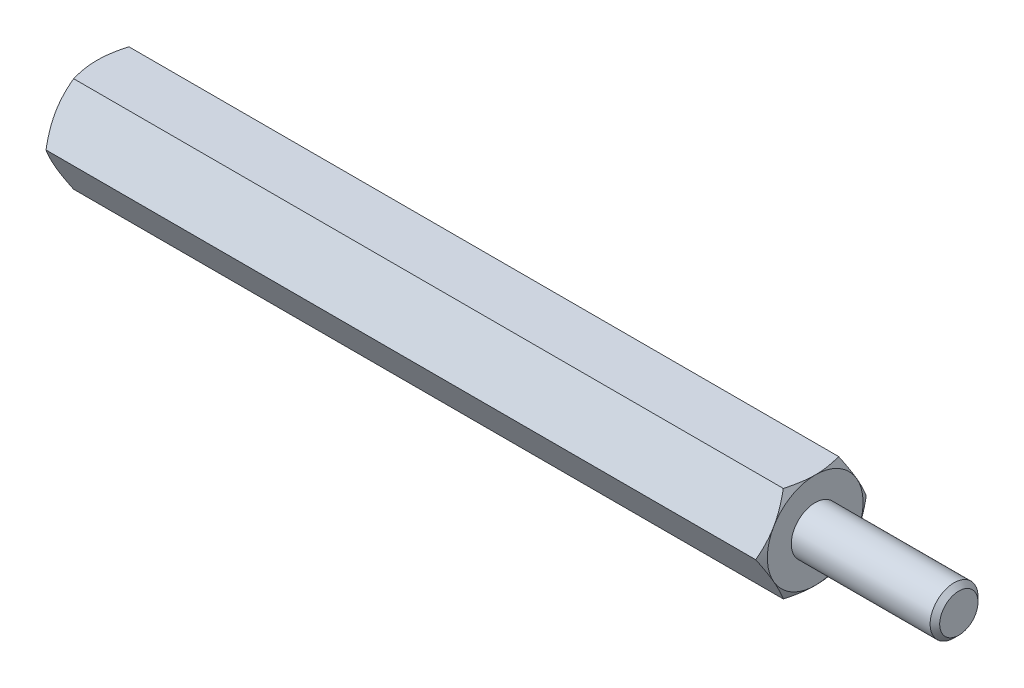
ISO-10303-21;
HEADER;
FILE_DESCRIPTION(('STEP AP214'),'2;1');
FILE_NAME('part.step','',(''),(''),'','','');
FILE_SCHEMA(('AUTOMOTIVE_DESIGN { 1 0 10303 214 1 1 1 1 }'));
ENDSEC;
DATA;
#1=APPLICATION_CONTEXT('core data for automotive mechanical design processes');
#2=APPLICATION_PROTOCOL_DEFINITION('international standard','automotive_design',2000,#1);
#3=PRODUCT_CONTEXT('',#1,'mechanical');
#4=PRODUCT('Part','Part','',(#3));
#5=PRODUCT_RELATED_PRODUCT_CATEGORY('part','',(#4));
#6=PRODUCT_DEFINITION_FORMATION('','',#4);
#7=PRODUCT_DEFINITION_CONTEXT('part definition',#1,'design');
#8=PRODUCT_DEFINITION('design','',#6,#7);
#9=PRODUCT_DEFINITION_SHAPE('','',#8);
#10=(LENGTH_UNIT() NAMED_UNIT(*) SI_UNIT(.MILLI.,.METRE.));
#11=(NAMED_UNIT(*) PLANE_ANGLE_UNIT() SI_UNIT($,.RADIAN.));
#12=(NAMED_UNIT(*) SI_UNIT($,.STERADIAN.) SOLID_ANGLE_UNIT());
#13=UNCERTAINTY_MEASURE_WITH_UNIT(LENGTH_MEASURE(1.E-05),#10,'distance_accuracy_value','');
#14=(GEOMETRIC_REPRESENTATION_CONTEXT(3) GLOBAL_UNCERTAINTY_ASSIGNED_CONTEXT((#13)) GLOBAL_UNIT_ASSIGNED_CONTEXT((#10,
#11,#12)) REPRESENTATION_CONTEXT('',''));
#15=CARTESIAN_POINT('',(0.,0.,0.));
#16=DIRECTION('',(0.,0.,1.));
#17=DIRECTION('',(1.,0.,0.));
#18=AXIS2_PLACEMENT_3D('',#15,#16,#17);
#19=CARTESIAN_POINT('',(15.,2.,-1.15470053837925));
#20=DIRECTION('',(1.,0.,0.));
#21=DIRECTION('',(0.,0.,-1.));
#22=AXIS2_PLACEMENT_3D('',#19,#20,#21);
#23=PLANE('',#22);
#24=CARTESIAN_POINT('',(15.,0.,0.));
#25=DIRECTION('',(1.,0.,0.));
#26=DIRECTION('',(0.,0.,-1.));
#27=AXIS2_PLACEMENT_3D('',#24,#25,#26);
#28=CIRCLE('',#27,2.);
#29=CARTESIAN_POINT('',(15.,-1.,-1.73205080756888));
#30=VERTEX_POINT('',#29);
#31=CARTESIAN_POINT('',(15.,0.999999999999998,-1.73205080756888));
#32=VERTEX_POINT('',#31);
#33=EDGE_CURVE('E288',#30,#32,#28,.T.);
#34=ORIENTED_EDGE('',*,*,#33,.T.);
#35=CARTESIAN_POINT('',(15.,2.,0.));
#36=VERTEX_POINT('',#35);
#37=EDGE_CURVE('E53',#32,#36,#28,.T.);
#38=ORIENTED_EDGE('',*,*,#37,.T.);
#39=CARTESIAN_POINT('',(15.,0.999999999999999,1.73205080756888));
#40=VERTEX_POINT('',#39);
#41=EDGE_CURVE('E297',#36,#40,#28,.T.);
#42=ORIENTED_EDGE('',*,*,#41,.T.);
#43=CARTESIAN_POINT('',(15.,-1.,1.73205080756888));
#44=VERTEX_POINT('',#43);
#45=EDGE_CURVE('E302',#40,#44,#28,.T.);
#46=ORIENTED_EDGE('',*,*,#45,.T.);
#47=CARTESIAN_POINT('',(15.,0.,0.));
#48=DIRECTION('',(-1.,0.,0.));
#49=DIRECTION('',(0.,-1.,0.));
#50=AXIS2_PLACEMENT_3D('',#47,#48,#49);
#51=CIRCLE('',#50,2.);
#52=CARTESIAN_POINT('',(15.,-2.00000000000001,0.));
#53=VERTEX_POINT('',#52);
#54=EDGE_CURVE('E193',#53,#44,#51,.T.);
#55=ORIENTED_EDGE('',*,*,#54,.F.);
#56=EDGE_CURVE('E61',#53,#30,#28,.T.);
#57=ORIENTED_EDGE('',*,*,#56,.T.);
#58=EDGE_LOOP('',(#34,#38,#42,#46,#55,#57));
#59=FACE_BOUND('',#58,.T.);
#60=CARTESIAN_POINT('',(15.,0.,0.));
#61=DIRECTION('',(1.,0.,0.));
#62=DIRECTION('',(0.,0.,-1.));
#63=AXIS2_PLACEMENT_3D('',#60,#61,#62);
#64=CIRCLE('',#63,1.);
#65=CARTESIAN_POINT('',(15.,0.,-1.));
#66=VERTEX_POINT('',#65);
#67=EDGE_CURVE('E320',#66,#66,#64,.T.);
#68=ORIENTED_EDGE('',*,*,#67,.F.);
#69=EDGE_LOOP('',(#68));
#70=FACE_BOUND('',#69,.T.);
#71=ADVANCED_FACE('F37',(#59,#70),#23,.T.);
#72=CARTESIAN_POINT('',(15.,0.,-2.3094010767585));
#73=DIRECTION('',(0.,-0.5,0.866025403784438));
#74=DIRECTION('',(0.,-0.866025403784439,-0.5));
#75=AXIS2_PLACEMENT_3D('',#72,#73,#74);
#76=PLANE('',#75);
#77=CARTESIAN_POINT('',(14.8213005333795,-0.000200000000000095,-2.30951654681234));
#78=CARTESIAN_POINT('',(14.8506104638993,0.0876912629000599,-2.25877250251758));
#79=CARTESIAN_POINT('',(14.8772671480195,0.176341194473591,-2.20759044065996));
#80=CARTESIAN_POINT('',(14.9237975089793,0.355176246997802,-2.10433997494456));
#81=CARTESIAN_POINT('',(14.9436547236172,0.445364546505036,-2.05226973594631));
#82=CARTESIAN_POINT('',(14.9745665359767,0.624623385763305,-1.94877459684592));
#83=CARTESIAN_POINT('',(14.9858268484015,0.713666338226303,-1.89736562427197));
#84=CARTESIAN_POINT('',(14.9992713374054,0.892171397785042,-1.79430568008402));
#85=CARTESIAN_POINT('',(15.0014666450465,0.981632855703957,-1.74265508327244));
#86=CARTESIAN_POINT('',(14.9969090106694,1.1488083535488,-1.64613626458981));
#87=CARTESIAN_POINT('',(14.991275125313,1.22654737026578,-1.60125362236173));
#88=CARTESIAN_POINT('',(14.9734161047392,1.38151891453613,-1.51178075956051));
#89=CARTESIAN_POINT('',(14.9611848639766,1.4587509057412,-1.46719084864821));
#90=CARTESIAN_POINT('',(14.9306065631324,1.6140421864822,-1.37753338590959));
#91=CARTESIAN_POINT('',(14.9121298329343,1.69208181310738,-1.33247718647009));
#92=CARTESIAN_POINT('',(14.8701944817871,1.84699686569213,-1.24303693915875));
#93=CARTESIAN_POINT('',(14.8467457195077,1.92387427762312,-1.1986517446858));
#94=CARTESIAN_POINT('',(14.8213005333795,2.0002,-1.15458506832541));
#95=B_SPLINE_CURVE_WITH_KNOTS('',3,(#77,#78,#79,#80,#81,#82,#83,#84,#85,#86,#87,#88,#89,#90,#91,
#92,#93,#94),.UNSPECIFIED.,.F.,.F.,(4,2,2,2,2,2,2,2,4),(0.,0.31703182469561,0.634825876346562,
0.944753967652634,1.25430138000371,1.52387047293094,1.79368946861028,2.06949491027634,
2.34475850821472),.UNSPECIFIED.);
#96=CARTESIAN_POINT('',(14.8213672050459,0.,-2.3094010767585));
#97=VERTEX_POINT('',#96);
#98=EDGE_CURVE('E318',#97,#32,#95,.T.);
#99=ORIENTED_EDGE('',*,*,#98,.F.);
#100=DIRECTION('',(-1.,0.,0.));
#101=VECTOR('',#100,1.);
#102=CARTESIAN_POINT('',(15.,0.,-2.3094010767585));
#103=LINE('',#102,#101);
#104=CARTESIAN_POINT('',(-14.8213672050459,0.,-2.3094010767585));
#105=VERTEX_POINT('',#104);
#106=EDGE_CURVE('E264',#97,#105,#103,.T.);
#107=ORIENTED_EDGE('',*,*,#106,.T.);
#108=CARTESIAN_POINT('',(-14.8213005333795,2.0002,-1.15458506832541));
#109=CARTESIAN_POINT('',(-14.8506104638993,1.91230873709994,-1.20532911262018));
#110=CARTESIAN_POINT('',(-14.8772671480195,1.82365880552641,-1.2565111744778));
#111=CARTESIAN_POINT('',(-14.9237975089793,1.6448237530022,-1.35976164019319));
#112=CARTESIAN_POINT('',(-14.9436547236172,1.55463545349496,-1.41183187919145));
#113=CARTESIAN_POINT('',(-14.9745665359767,1.37537661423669,-1.51532701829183));
#114=CARTESIAN_POINT('',(-14.9858268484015,1.2863336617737,-1.56673599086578));
#115=CARTESIAN_POINT('',(-14.9992713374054,1.10782860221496,-1.66979593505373));
#116=CARTESIAN_POINT('',(-15.0014666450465,1.01836714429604,-1.72144653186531));
#117=CARTESIAN_POINT('',(-14.9969090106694,0.851191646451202,-1.81796535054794));
#118=CARTESIAN_POINT('',(-14.991275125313,0.773452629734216,-1.86284799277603));
#119=CARTESIAN_POINT('',(-14.9734161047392,0.618481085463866,-1.95232085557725));
#120=CARTESIAN_POINT('',(-14.9611848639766,0.541249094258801,-1.99691076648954));
#121=CARTESIAN_POINT('',(-14.9306065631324,0.385957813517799,-2.08656822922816));
#122=CARTESIAN_POINT('',(-14.9121298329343,0.30791818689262,-2.13162442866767));
#123=CARTESIAN_POINT('',(-14.8701944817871,0.153003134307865,-2.221064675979));
#124=CARTESIAN_POINT('',(-14.8467457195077,0.0761257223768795,-2.26544987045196));
#125=CARTESIAN_POINT('',(-14.8213005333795,-0.000200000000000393,-2.30951654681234));
#126=B_SPLINE_CURVE_WITH_KNOTS('',3,(#108,#109,#110,#111,#112,#113,#114,#115,#116,#117,#118,
#119,#120,#121,#122,#123,#124,#125),.UNSPECIFIED.,.F.,.F.,(4,2,2,2,2,2,2,2,4),(0.,
0.31703182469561,0.634825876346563,0.944753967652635,1.25430138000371,1.52387047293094,
1.79368946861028,2.06949491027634,2.34475850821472),.UNSPECIFIED.);
#127=CARTESIAN_POINT('',(-15.,0.999999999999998,-1.73205080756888));
#128=VERTEX_POINT('',#127);
#129=EDGE_CURVE('E404',#128,#105,#126,.T.);
#130=ORIENTED_EDGE('',*,*,#129,.F.);
#131=CARTESIAN_POINT('',(-14.8213672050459,2.,-1.15470053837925));
#132=VERTEX_POINT('',#131);
#133=EDGE_CURVE('E400',#132,#128,#126,.T.);
#134=ORIENTED_EDGE('',*,*,#133,.F.);
#135=DIRECTION('',(-1.,0.,0.));
#136=VECTOR('',#135,1.);
#137=CARTESIAN_POINT('',(15.,2.,-1.15470053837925));
#138=LINE('',#137,#136);
#139=CARTESIAN_POINT('',(14.821367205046,2.,-1.15470053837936));
#140=VERTEX_POINT('',#139);
#141=EDGE_CURVE('E279',#140,#132,#138,.T.);
#142=ORIENTED_EDGE('',*,*,#141,.F.);
#143=EDGE_CURVE('E229',#32,#140,#95,.T.);
#144=ORIENTED_EDGE('',*,*,#143,.F.);
#145=EDGE_LOOP('',(#99,#107,#130,#134,#142,#144));
#146=FACE_BOUND('',#145,.T.);
#147=ADVANCED_FACE('F148',(#146),#76,.F.);
#148=CARTESIAN_POINT('',(15.,2.,-1.15470053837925));
#149=DIRECTION('',(0.,-1.,0.));
#150=DIRECTION('',(0.,0.,-1.));
#151=AXIS2_PLACEMENT_3D('',#148,#149,#150);
#152=PLANE('',#151);
#153=CARTESIAN_POINT('',(14.0041453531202,2.,-3.14239762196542));
#154=CARTESIAN_POINT('',(14.0468568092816,2.,-3.05468337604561));
#155=CARTESIAN_POINT('',(14.0891703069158,2.,-2.96677207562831));
#156=CARTESIAN_POINT('',(14.1727783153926,2.,-2.79045070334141));
#157=CARTESIAN_POINT('',(14.2140726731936,2.,-2.70204055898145));
#158=CARTESIAN_POINT('',(14.2956183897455,2.,-2.52418069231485));
#159=CARTESIAN_POINT('',(14.3358631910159,2.,-2.43472795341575));
#160=CARTESIAN_POINT('',(14.4147590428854,2.,-2.25512498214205));
#161=CARTESIAN_POINT('',(14.4534101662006,2.,-2.16497478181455));
#162=CARTESIAN_POINT('',(14.5299661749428,2.,-1.98078525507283));
#163=CARTESIAN_POINT('',(14.5678021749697,2.,-1.88671714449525));
#164=CARTESIAN_POINT('',(14.6407004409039,2.,-1.69751412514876));
#165=CARTESIAN_POINT('',(14.6757629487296,2.,-1.60237931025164));
#166=CARTESIAN_POINT('',(14.7422353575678,2.,-1.41102905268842));
#167=CARTESIAN_POINT('',(14.7736519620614,2.,-1.31481596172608));
#168=CARTESIAN_POINT('',(14.8318476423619,2.,-1.12101028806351));
#169=CARTESIAN_POINT('',(14.8586281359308,2.,-1.02341813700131));
#170=CARTESIAN_POINT('',(14.9061516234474,2.,-0.827336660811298));
#171=CARTESIAN_POINT('',(14.9269281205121,2.,-0.728855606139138));
#172=CARTESIAN_POINT('',(14.9612955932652,2.,-0.530628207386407));
#173=CARTESIAN_POINT('',(14.9748873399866,2.,-0.430882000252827));
#174=CARTESIAN_POINT('',(14.9936215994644,2.,-0.231937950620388));
#175=CARTESIAN_POINT('',(14.998875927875,2.,-0.132750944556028));
#176=CARTESIAN_POINT('',(15.0007996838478,2.,0.0657049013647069));
#177=CARTESIAN_POINT('',(14.9974689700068,2.,0.164973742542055));
#178=CARTESIAN_POINT('',(14.9796512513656,2.,0.400692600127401));
#179=CARTESIAN_POINT('',(14.9613884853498,2.,0.53685971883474));
#180=CARTESIAN_POINT('',(14.9117995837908,2.,0.80679264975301));
#181=CARTESIAN_POINT('',(14.8804615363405,2.,0.940556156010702));
#182=CARTESIAN_POINT('',(14.8073369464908,2.,1.20849227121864));
#183=CARTESIAN_POINT('',(14.7653231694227,2.,1.34260127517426));
#184=CARTESIAN_POINT('',(14.6970115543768,2.,1.54188460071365));
#185=CARTESIAN_POINT('',(14.6733612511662,2.,1.6079939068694));
#186=CARTESIAN_POINT('',(14.6245731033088,2.,1.73966131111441));
#187=CARTESIAN_POINT('',(14.5994352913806,2.,1.80521942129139));
#188=CARTESIAN_POINT('',(14.5304524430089,2.,1.98014362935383));
#189=CARTESIAN_POINT('',(14.4854828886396,2.,2.08906517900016));
#190=CARTESIAN_POINT('',(14.3929395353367,2.,2.3058004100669));
#191=CARTESIAN_POINT('',(14.345365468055,2.,2.41361397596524));
#192=CARTESIAN_POINT('',(14.2482262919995,2.,2.62838132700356));
#193=CARTESIAN_POINT('',(14.1986605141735,2.,2.7353348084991));
#194=CARTESIAN_POINT('',(14.0980014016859,2.,2.94852186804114));
#195=CARTESIAN_POINT('',(14.046908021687,2.,3.05475542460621));
#196=CARTESIAN_POINT('',(13.8916961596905,2.,3.37291303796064));
#197=CARTESIAN_POINT('',(13.7857965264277,2.,3.58396705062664));
#198=CARTESIAN_POINT('',(13.5710098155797,2.,4.00448363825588));
#199=CARTESIAN_POINT('',(13.4621233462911,2.,4.21394652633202));
#200=CARTESIAN_POINT('',(13.2537677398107,2.,4.61000648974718));
#201=CARTESIAN_POINT('',(13.1545007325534,2.,4.79671008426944));
#202=CARTESIAN_POINT('',(12.9547641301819,2.,5.16948614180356));
#203=CARTESIAN_POINT('',(12.8542944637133,2.,5.35555856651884));
#204=CARTESIAN_POINT('',(12.6527937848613,2.,5.72660635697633));
#205=CARTESIAN_POINT('',(12.5517657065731,2.,5.91158331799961));
#206=CARTESIAN_POINT('',(12.3490239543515,2.,6.28114276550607));
#207=CARTESIAN_POINT('',(12.2473103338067,2.,6.46572528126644));
#208=CARTESIAN_POINT('',(12.1453470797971,2.,6.65016883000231));
#209=B_SPLINE_CURVE_WITH_KNOTS('',3,(#153,#154,#155,#156,#157,#158,#159,#160,#161,#162,#163,
#164,#165,#166,#167,#168,#169,#170,#171,#172,#173,#174,#175,#176,#177,#178,#179,#180,#181,#182,
#183,#184,#185,#186,#187,#188,#189,#190,#191,#192,#193,#194,#195,#196,#197,#198,#199,#200,#201,
#202,#203,#204,#205,#206,#207,#208),.UNSPECIFIED.,.F.,.F.,(4,2,2,2,2,2,2,2,2,2,2,2,2,2,2,2,2,2,
2,2,2,2,2,2,2,2,2,4),(0.,0.292684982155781,0.585413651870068,0.879667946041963,1.17390879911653,
1.47805164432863,1.78216793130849,2.08571589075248,2.38917085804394,2.690898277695,
2.99259331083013,3.29020694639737,3.58782548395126,3.99913738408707,4.41082482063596,
4.8321411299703,5.0427662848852,5.25338680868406,5.60685637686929,5.96036243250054,
6.31398824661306,6.66762456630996,7.37597688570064,8.08418599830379,8.71853756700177,
9.3529269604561,9.98522933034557,10.6174830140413),.UNSPECIFIED.);
#210=EDGE_CURVE('E227',#140,#36,#209,.T.);
#211=ORIENTED_EDGE('',*,*,#210,.F.);
#212=ORIENTED_EDGE('',*,*,#141,.T.);
#213=CARTESIAN_POINT('',(-14.0041453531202,2.,-3.14239762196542));
#214=CARTESIAN_POINT('',(-14.0468568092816,2.,-3.05468337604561));
#215=CARTESIAN_POINT('',(-14.0891703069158,2.,-2.96677207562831));
#216=CARTESIAN_POINT('',(-14.1727783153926,2.,-2.79045070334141));
#217=CARTESIAN_POINT('',(-14.2140726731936,2.,-2.70204055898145));
#218=CARTESIAN_POINT('',(-14.2956183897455,2.,-2.52418069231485));
#219=CARTESIAN_POINT('',(-14.3358631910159,2.,-2.43472795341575));
#220=CARTESIAN_POINT('',(-14.4147590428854,2.,-2.25512498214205));
#221=CARTESIAN_POINT('',(-14.4534101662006,2.,-2.16497478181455));
#222=CARTESIAN_POINT('',(-14.5299661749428,2.,-1.98078525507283));
#223=CARTESIAN_POINT('',(-14.5678021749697,2.,-1.88671714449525));
#224=CARTESIAN_POINT('',(-14.6407004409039,2.,-1.69751412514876));
#225=CARTESIAN_POINT('',(-14.6757629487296,2.,-1.60237931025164));
#226=CARTESIAN_POINT('',(-14.7422353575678,2.,-1.41102905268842));
#227=CARTESIAN_POINT('',(-14.7736519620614,2.,-1.31481596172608));
#228=CARTESIAN_POINT('',(-14.8318476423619,2.,-1.12101028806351));
#229=CARTESIAN_POINT('',(-14.8586281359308,2.,-1.02341813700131));
#230=CARTESIAN_POINT('',(-14.9061516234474,2.,-0.827336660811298));
#231=CARTESIAN_POINT('',(-14.9269281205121,2.,-0.728855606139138));
#232=CARTESIAN_POINT('',(-14.9612955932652,2.,-0.530628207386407));
#233=CARTESIAN_POINT('',(-14.9748873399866,2.,-0.430882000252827));
#234=CARTESIAN_POINT('',(-14.9936215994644,2.,-0.231937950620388));
#235=CARTESIAN_POINT('',(-14.998875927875,2.,-0.132750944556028));
#236=CARTESIAN_POINT('',(-15.0007996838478,2.,0.0657049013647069));
#237=CARTESIAN_POINT('',(-14.9974689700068,2.,0.164973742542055));
#238=CARTESIAN_POINT('',(-14.9796512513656,2.,0.400692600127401));
#239=CARTESIAN_POINT('',(-14.9613884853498,2.,0.53685971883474));
#240=CARTESIAN_POINT('',(-14.9117995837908,2.,0.806792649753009));
#241=CARTESIAN_POINT('',(-14.8804615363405,2.,0.940556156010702));
#242=CARTESIAN_POINT('',(-14.8073369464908,2.,1.20849227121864));
#243=CARTESIAN_POINT('',(-14.7653231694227,2.,1.34260127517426));
#244=CARTESIAN_POINT('',(-14.6970115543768,2.,1.54188460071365));
#245=CARTESIAN_POINT('',(-14.6733612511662,2.,1.6079939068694));
#246=CARTESIAN_POINT('',(-14.6245731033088,2.,1.73966131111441));
#247=CARTESIAN_POINT('',(-14.5994352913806,2.,1.80521942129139));
#248=CARTESIAN_POINT('',(-14.530452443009,2.,1.98014362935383));
#249=CARTESIAN_POINT('',(-14.4854828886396,2.,2.08906517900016));
#250=CARTESIAN_POINT('',(-14.3929395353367,2.,2.3058004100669));
#251=CARTESIAN_POINT('',(-14.345365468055,2.,2.41361397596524));
#252=CARTESIAN_POINT('',(-14.2482262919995,2.,2.62838132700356));
#253=CARTESIAN_POINT('',(-14.1986605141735,2.,2.7353348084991));
#254=CARTESIAN_POINT('',(-14.0980014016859,2.,2.94852186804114));
#255=CARTESIAN_POINT('',(-14.046908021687,2.,3.05475542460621));
#256=CARTESIAN_POINT('',(-13.8916961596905,2.,3.37291303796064));
#257=CARTESIAN_POINT('',(-13.7857965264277,2.,3.58396705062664));
#258=CARTESIAN_POINT('',(-13.5710098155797,2.,4.00448363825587));
#259=CARTESIAN_POINT('',(-13.4621233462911,2.,4.21394652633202));
#260=CARTESIAN_POINT('',(-13.2537677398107,2.,4.61000648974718));
#261=CARTESIAN_POINT('',(-13.1545007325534,2.,4.79671008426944));
#262=CARTESIAN_POINT('',(-12.9547641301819,2.,5.16948614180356));
#263=CARTESIAN_POINT('',(-12.8542944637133,2.,5.35555856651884));
#264=CARTESIAN_POINT('',(-12.6527937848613,2.,5.72660635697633));
#265=CARTESIAN_POINT('',(-12.5517657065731,2.,5.9115833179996));
#266=CARTESIAN_POINT('',(-12.3490239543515,2.,6.28114276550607));
#267=CARTESIAN_POINT('',(-12.2473103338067,2.,6.46572528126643));
#268=CARTESIAN_POINT('',(-12.1453470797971,2.,6.65016883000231));
#269=B_SPLINE_CURVE_WITH_KNOTS('',3,(#213,#214,#215,#216,#217,#218,#219,#220,#221,#222,#223,
#224,#225,#226,#227,#228,#229,#230,#231,#232,#233,#234,#235,#236,#237,#238,#239,#240,#241,#242,
#243,#244,#245,#246,#247,#248,#249,#250,#251,#252,#253,#254,#255,#256,#257,#258,#259,#260,#261,
#262,#263,#264,#265,#266,#267,#268),.UNSPECIFIED.,.F.,.F.,(4,2,2,2,2,2,2,2,2,2,2,2,2,2,2,2,2,2,
2,2,2,2,2,2,2,2,2,4),(0.,0.292684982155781,0.585413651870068,0.879667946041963,1.17390879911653,
1.47805164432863,1.78216793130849,2.08571589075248,2.38917085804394,2.690898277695,
2.99259331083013,3.29020694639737,3.58782548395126,3.99913738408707,4.41082482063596,
4.8321411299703,5.0427662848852,5.25338680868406,5.60685637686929,5.96036243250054,
6.31398824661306,6.66762456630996,7.37597688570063,8.08418599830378,8.71853756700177,
9.3529269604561,9.98522933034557,10.6174830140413),.UNSPECIFIED.);
#270=CARTESIAN_POINT('',(-15.,2.,0.));
#271=VERTEX_POINT('',#270);
#272=EDGE_CURVE('E241',#271,#132,#269,.F.);
#273=ORIENTED_EDGE('',*,*,#272,.F.);
#274=CARTESIAN_POINT('',(-14.8213672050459,2.,1.15470053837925));
#275=VERTEX_POINT('',#274);
#276=EDGE_CURVE('E249',#275,#271,#269,.F.);
#277=ORIENTED_EDGE('',*,*,#276,.F.);
#278=DIRECTION('',(-1.,0.,0.));
#279=VECTOR('',#278,1.);
#280=CARTESIAN_POINT('',(15.,2.,1.15470053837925));
#281=LINE('',#280,#279);
#282=CARTESIAN_POINT('',(14.8213672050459,2.,1.15470053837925));
#283=VERTEX_POINT('',#282);
#284=EDGE_CURVE('E276',#283,#275,#281,.T.);
#285=ORIENTED_EDGE('',*,*,#284,.F.);
#286=EDGE_CURVE('E221',#36,#283,#209,.T.);
#287=ORIENTED_EDGE('',*,*,#286,.F.);
#288=EDGE_LOOP('',(#211,#212,#273,#277,#285,#287));
#289=FACE_BOUND('',#288,.T.);
#290=ADVANCED_FACE('F153',(#289),#152,.F.);
#291=CARTESIAN_POINT('',(15.,2.,1.15470053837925));
#292=DIRECTION('',(0.,-0.5,-0.866025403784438));
#293=DIRECTION('',(0.,0.866025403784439,-0.5));
#294=AXIS2_PLACEMENT_3D('',#291,#292,#293);
#295=PLANE('',#294);
#296=CARTESIAN_POINT('',(14.8213005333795,2.0002,1.15458506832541));
#297=CARTESIAN_POINT('',(14.8506104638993,1.91230873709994,1.20532911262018));
#298=CARTESIAN_POINT('',(14.8772671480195,1.82365880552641,1.2565111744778));
#299=CARTESIAN_POINT('',(14.9237975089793,1.6448237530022,1.35976164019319));
#300=CARTESIAN_POINT('',(14.9436547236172,1.55463545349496,1.41183187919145));
#301=CARTESIAN_POINT('',(14.9745665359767,1.37537661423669,1.51532701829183));
#302=CARTESIAN_POINT('',(14.9858268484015,1.2863336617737,1.56673599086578));
#303=CARTESIAN_POINT('',(14.9992713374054,1.10782860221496,1.66979593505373));
#304=CARTESIAN_POINT('',(15.0014666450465,1.01836714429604,1.72144653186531));
#305=CARTESIAN_POINT('',(14.9969090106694,0.851191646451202,1.81796535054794));
#306=CARTESIAN_POINT('',(14.991275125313,0.773452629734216,1.86284799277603));
#307=CARTESIAN_POINT('',(14.9734161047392,0.618481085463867,1.95232085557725));
#308=CARTESIAN_POINT('',(14.9611848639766,0.541249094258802,1.99691076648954));
#309=CARTESIAN_POINT('',(14.9306065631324,0.3859578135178,2.08656822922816));
#310=CARTESIAN_POINT('',(14.9121298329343,0.307918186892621,2.13162442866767));
#311=CARTESIAN_POINT('',(14.8701944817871,0.153003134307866,2.221064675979));
#312=CARTESIAN_POINT('',(14.8467457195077,0.0761257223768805,2.26544987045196));
#313=CARTESIAN_POINT('',(14.8213005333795,-0.000199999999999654,2.30951654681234));
#314=B_SPLINE_CURVE_WITH_KNOTS('',3,(#296,#297,#298,#299,#300,#301,#302,#303,#304,#305,#306,
#307,#308,#309,#310,#311,#312,#313),.UNSPECIFIED.,.F.,.F.,(4,2,2,2,2,2,2,2,4),(0.,
0.31703182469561,0.634825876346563,0.944753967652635,1.25430138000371,1.52387047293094,
1.79368946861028,2.06949491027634,2.34475850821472),.UNSPECIFIED.);
#315=EDGE_CURVE('E228',#283,#40,#314,.T.);
#316=ORIENTED_EDGE('',*,*,#315,.F.);
#317=ORIENTED_EDGE('',*,*,#284,.T.);
#318=CARTESIAN_POINT('',(-14.8213005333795,-0.000199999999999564,2.30951654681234));
#319=CARTESIAN_POINT('',(-14.8506104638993,0.0876912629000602,2.25877250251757));
#320=CARTESIAN_POINT('',(-14.8772671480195,0.176341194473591,2.20759044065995));
#321=CARTESIAN_POINT('',(-14.9237975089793,0.355176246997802,2.10433997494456));
#322=CARTESIAN_POINT('',(-14.9436547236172,0.445364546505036,2.0522697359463));
#323=CARTESIAN_POINT('',(-14.9745665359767,0.624623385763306,1.94877459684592));
#324=CARTESIAN_POINT('',(-14.9858268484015,0.713666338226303,1.89736562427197));
#325=CARTESIAN_POINT('',(-14.9992713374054,0.892171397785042,1.79430568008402));
#326=CARTESIAN_POINT('',(-15.0014666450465,0.981632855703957,1.74265508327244));
#327=CARTESIAN_POINT('',(-14.9969090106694,1.1488083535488,1.64613626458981));
#328=CARTESIAN_POINT('',(-14.991275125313,1.22654737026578,1.60125362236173));
#329=CARTESIAN_POINT('',(-14.9734161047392,1.38151891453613,1.51178075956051));
#330=CARTESIAN_POINT('',(-14.9611848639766,1.4587509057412,1.46719084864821));
#331=CARTESIAN_POINT('',(-14.9306065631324,1.6140421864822,1.37753338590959));
#332=CARTESIAN_POINT('',(-14.9121298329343,1.69208181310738,1.33247718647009));
#333=CARTESIAN_POINT('',(-14.8701944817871,1.84699686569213,1.24303693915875));
#334=CARTESIAN_POINT('',(-14.8467457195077,1.92387427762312,1.1986517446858));
#335=CARTESIAN_POINT('',(-14.8213005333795,2.0002,1.15458506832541));
#336=B_SPLINE_CURVE_WITH_KNOTS('',3,(#318,#319,#320,#321,#322,#323,#324,#325,#326,#327,#328,
#329,#330,#331,#332,#333,#334,#335),.UNSPECIFIED.,.F.,.F.,(4,2,2,2,2,2,2,2,4),(0.,
0.317031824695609,0.634825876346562,0.944753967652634,1.25430138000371,1.52387047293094,
1.79368946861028,2.06949491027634,2.34475850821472),.UNSPECIFIED.);
#337=CARTESIAN_POINT('',(-15.,0.999999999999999,1.73205080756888));
#338=VERTEX_POINT('',#337);
#339=EDGE_CURVE('E255',#338,#275,#336,.T.);
#340=ORIENTED_EDGE('',*,*,#339,.F.);
#341=CARTESIAN_POINT('',(-14.8213672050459,0.,2.3094010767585));
#342=VERTEX_POINT('',#341);
#343=EDGE_CURVE('E262',#342,#338,#336,.T.);
#344=ORIENTED_EDGE('',*,*,#343,.F.);
#345=DIRECTION('',(-1.,0.,0.));
#346=VECTOR('',#345,1.);
#347=CARTESIAN_POINT('',(15.,0.,2.3094010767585));
#348=LINE('',#347,#346);
#349=CARTESIAN_POINT('',(14.8213672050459,0.,2.3094010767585));
#350=VERTEX_POINT('',#349);
#351=EDGE_CURVE('E273',#350,#342,#348,.T.);
#352=ORIENTED_EDGE('',*,*,#351,.F.);
#353=EDGE_CURVE('E215',#40,#350,#314,.T.);
#354=ORIENTED_EDGE('',*,*,#353,.F.);
#355=EDGE_LOOP('',(#316,#317,#340,#344,#352,#354));
#356=FACE_BOUND('',#355,.T.);
#357=ADVANCED_FACE('F235',(#356),#295,.F.);
#358=CARTESIAN_POINT('',(15.,0.,2.3094010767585));
#359=DIRECTION('',(0.,0.5,-0.866025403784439));
#360=DIRECTION('',(0.,0.866025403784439,0.5));
#361=AXIS2_PLACEMENT_3D('',#358,#359,#360);
#362=PLANE('',#361);
#363=CARTESIAN_POINT('',(14.8213005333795,0.00020000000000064,2.30951654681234));
#364=CARTESIAN_POINT('',(14.8506104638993,-0.0876912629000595,2.25877250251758));
#365=CARTESIAN_POINT('',(14.8772671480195,-0.17634119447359,2.20759044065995));
#366=CARTESIAN_POINT('',(14.9237975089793,-0.355176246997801,2.10433997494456));
#367=CARTESIAN_POINT('',(14.9436547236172,-0.445364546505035,2.0522697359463));
#368=CARTESIAN_POINT('',(14.9745665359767,-0.624623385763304,1.94877459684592));
#369=CARTESIAN_POINT('',(14.9858268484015,-0.713666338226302,1.89736562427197));
#370=CARTESIAN_POINT('',(14.9992713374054,-0.892171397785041,1.79430568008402));
#371=CARTESIAN_POINT('',(15.0014666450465,-0.981632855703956,1.74265508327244));
#372=CARTESIAN_POINT('',(14.9969090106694,-1.1488083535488,1.64613626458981));
#373=CARTESIAN_POINT('',(14.991275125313,-1.22654737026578,1.60125362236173));
#374=CARTESIAN_POINT('',(14.9734161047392,-1.38151891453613,1.51178075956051));
#375=CARTESIAN_POINT('',(14.9611848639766,-1.4587509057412,1.46719084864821));
#376=CARTESIAN_POINT('',(14.9306065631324,-1.6140421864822,1.37753338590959));
#377=CARTESIAN_POINT('',(14.9121298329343,-1.69208181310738,1.33247718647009));
#378=CARTESIAN_POINT('',(14.8701944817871,-1.84699686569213,1.24303693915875));
#379=CARTESIAN_POINT('',(14.8467457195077,-1.92387427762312,1.1986517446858));
#380=CARTESIAN_POINT('',(14.8213005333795,-2.0002,1.15458506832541));
#381=B_SPLINE_CURVE_WITH_KNOTS('',3,(#363,#364,#365,#366,#367,#368,#369,#370,#371,#372,#373,
#374,#375,#376,#377,#378,#379,#380),.UNSPECIFIED.,.F.,.F.,(4,2,2,2,2,2,2,2,4),(0.,
0.317031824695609,0.634825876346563,0.944753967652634,1.25430138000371,1.52387047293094,
1.79368946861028,2.06949491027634,2.34475850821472),.UNSPECIFIED.);
#382=EDGE_CURVE('E319',#350,#44,#381,.T.);
#383=ORIENTED_EDGE('',*,*,#382,.F.);
#384=ORIENTED_EDGE('',*,*,#351,.T.);
#385=CARTESIAN_POINT('',(-14.8213005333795,-2.0002,1.15458506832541));
#386=CARTESIAN_POINT('',(-14.8506104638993,-1.91230873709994,1.20532911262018));
#387=CARTESIAN_POINT('',(-14.8772671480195,-1.82365880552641,1.2565111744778));
#388=CARTESIAN_POINT('',(-14.9237975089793,-1.6448237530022,1.35976164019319));
#389=CARTESIAN_POINT('',(-14.9436547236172,-1.55463545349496,1.41183187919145));
#390=CARTESIAN_POINT('',(-14.9745665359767,-1.3753766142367,1.51532701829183));
#391=CARTESIAN_POINT('',(-14.9858268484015,-1.2863336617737,1.56673599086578));
#392=CARTESIAN_POINT('',(-14.9992713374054,-1.10782860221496,1.66979593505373));
#393=CARTESIAN_POINT('',(-15.0014666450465,-1.01836714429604,1.72144653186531));
#394=CARTESIAN_POINT('',(-14.9969090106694,-0.851191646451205,1.81796535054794));
#395=CARTESIAN_POINT('',(-14.991275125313,-0.773452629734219,1.86284799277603));
#396=CARTESIAN_POINT('',(-14.9734161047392,-0.618481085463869,1.95232085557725));
#397=CARTESIAN_POINT('',(-14.9611848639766,-0.541249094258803,1.99691076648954));
#398=CARTESIAN_POINT('',(-14.9306065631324,-0.3859578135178,2.08656822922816));
#399=CARTESIAN_POINT('',(-14.9121298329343,-0.307918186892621,2.13162442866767));
#400=CARTESIAN_POINT('',(-14.8701944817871,-0.153003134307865,2.221064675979));
#401=CARTESIAN_POINT('',(-14.8467457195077,-0.0761257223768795,2.26544987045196));
#402=CARTESIAN_POINT('',(-14.8213005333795,0.000200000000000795,2.30951654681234));
#403=B_SPLINE_CURVE_WITH_KNOTS('',3,(#385,#386,#387,#388,#389,#390,#391,#392,#393,#394,#395,
#396,#397,#398,#399,#400,#401,#402),.UNSPECIFIED.,.F.,.F.,(4,2,2,2,2,2,2,2,4),(0.,
0.317031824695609,0.634825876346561,0.944753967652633,1.25430138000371,1.52387047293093,
1.79368946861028,2.06949491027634,2.34475850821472),.UNSPECIFIED.);
#404=CARTESIAN_POINT('',(-15.,-1.,1.73205080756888));
#405=VERTEX_POINT('',#404);
#406=EDGE_CURVE('E263',#405,#342,#403,.T.);
#407=ORIENTED_EDGE('',*,*,#406,.F.);
#408=CARTESIAN_POINT('',(-14.8213672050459,-2.,1.15470053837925));
#409=VERTEX_POINT('',#408);
#410=EDGE_CURVE('E250',#409,#405,#403,.T.);
#411=ORIENTED_EDGE('',*,*,#410,.F.);
#412=DIRECTION('',(-1.,0.,0.));
#413=VECTOR('',#412,1.);
#414=CARTESIAN_POINT('',(15.,-2.,1.15470053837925));
#415=LINE('',#414,#413);
#416=CARTESIAN_POINT('',(14.8213672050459,-2.,1.15470053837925));
#417=VERTEX_POINT('',#416);
#418=EDGE_CURVE('E270',#417,#409,#415,.T.);
#419=ORIENTED_EDGE('',*,*,#418,.F.);
#420=EDGE_CURVE('E210',#44,#417,#381,.T.);
#421=ORIENTED_EDGE('',*,*,#420,.F.);
#422=EDGE_LOOP('',(#383,#384,#407,#411,#419,#421));
#423=FACE_BOUND('',#422,.T.);
#424=ADVANCED_FACE('F427',(#423),#362,.F.);
#425=CARTESIAN_POINT('',(15.,-2.,1.15470053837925));
#426=DIRECTION('',(0.,1.,0.));
#427=DIRECTION('',(0.,0.,1.));
#428=AXIS2_PLACEMENT_3D('',#425,#426,#427);
#429=PLANE('',#428);
#430=CARTESIAN_POINT('',(14.0041453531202,-2.,-3.14239762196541));
#431=CARTESIAN_POINT('',(14.0468568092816,-2.,-3.05468337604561));
#432=CARTESIAN_POINT('',(14.0891703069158,-2.,-2.96677207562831));
#433=CARTESIAN_POINT('',(14.1727783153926,-2.,-2.79045070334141));
#434=CARTESIAN_POINT('',(14.2140726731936,-2.,-2.70204055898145));
#435=CARTESIAN_POINT('',(14.2956183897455,-2.,-2.52418069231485));
#436=CARTESIAN_POINT('',(14.3358631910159,-2.,-2.43472795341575));
#437=CARTESIAN_POINT('',(14.4147590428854,-2.,-2.25512498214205));
#438=CARTESIAN_POINT('',(14.4534101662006,-2.,-2.16497478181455));
#439=CARTESIAN_POINT('',(14.5299661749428,-2.,-1.98078525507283));
#440=CARTESIAN_POINT('',(14.5678021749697,-2.,-1.88671714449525));
#441=CARTESIAN_POINT('',(14.6407004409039,-2.,-1.69751412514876));
#442=CARTESIAN_POINT('',(14.6757629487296,-2.,-1.60237931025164));
#443=CARTESIAN_POINT('',(14.7422353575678,-2.,-1.41102905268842));
#444=CARTESIAN_POINT('',(14.7736519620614,-2.,-1.31481596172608));
#445=CARTESIAN_POINT('',(14.8318476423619,-2.,-1.12101028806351));
#446=CARTESIAN_POINT('',(14.8586281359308,-2.,-1.02341813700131));
#447=CARTESIAN_POINT('',(14.9061516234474,-2.,-0.827336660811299));
#448=CARTESIAN_POINT('',(14.9269281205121,-2.,-0.72885560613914));
#449=CARTESIAN_POINT('',(14.9612955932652,-2.,-0.530628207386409));
#450=CARTESIAN_POINT('',(14.9748873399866,-2.,-0.43088200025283));
#451=CARTESIAN_POINT('',(14.9936215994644,-2.,-0.231937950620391));
#452=CARTESIAN_POINT('',(14.998875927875,-2.,-0.132750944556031));
#453=CARTESIAN_POINT('',(15.0007996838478,-2.,0.0657049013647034));
#454=CARTESIAN_POINT('',(14.9974689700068,-2.,0.164973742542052));
#455=CARTESIAN_POINT('',(14.9796512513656,-2.,0.400692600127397));
#456=CARTESIAN_POINT('',(14.9613884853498,-2.,0.536859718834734));
#457=CARTESIAN_POINT('',(14.9117995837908,-2.,0.806792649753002));
#458=CARTESIAN_POINT('',(14.8804615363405,-2.,0.940556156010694));
#459=CARTESIAN_POINT('',(14.8073369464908,-2.,1.20849227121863));
#460=CARTESIAN_POINT('',(14.7653231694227,-2.,1.34260127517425));
#461=CARTESIAN_POINT('',(14.6970115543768,-2.,1.54188460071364));
#462=CARTESIAN_POINT('',(14.6733612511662,-2.,1.60799390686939));
#463=CARTESIAN_POINT('',(14.6245731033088,-2.,1.7396613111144));
#464=CARTESIAN_POINT('',(14.5994352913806,-2.,1.80521942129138));
#465=CARTESIAN_POINT('',(14.530452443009,-2.,1.98014362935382));
#466=CARTESIAN_POINT('',(14.4854828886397,-2.,2.08906517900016));
#467=CARTESIAN_POINT('',(14.3929395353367,-2.,2.30580041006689));
#468=CARTESIAN_POINT('',(14.345365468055,-2.,2.41361397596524));
#469=CARTESIAN_POINT('',(14.2482262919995,-2.,2.62838132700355));
#470=CARTESIAN_POINT('',(14.1986605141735,-2.,2.73533480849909));
#471=CARTESIAN_POINT('',(14.0980014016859,-2.,2.94852186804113));
#472=CARTESIAN_POINT('',(14.046908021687,-2.,3.0547554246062));
#473=CARTESIAN_POINT('',(13.8916961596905,-2.,3.37291303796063));
#474=CARTESIAN_POINT('',(13.7857965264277,-2.,3.58396705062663));
#475=CARTESIAN_POINT('',(13.5710098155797,-2.,4.00448363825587));
#476=CARTESIAN_POINT('',(13.4621233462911,-2.,4.21394652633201));
#477=CARTESIAN_POINT('',(13.2537677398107,-2.,4.61000648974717));
#478=CARTESIAN_POINT('',(13.1545007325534,-2.,4.79671008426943));
#479=CARTESIAN_POINT('',(12.9547641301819,-2.,5.16948614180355));
#480=CARTESIAN_POINT('',(12.8542944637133,-2.,5.35555856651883));
#481=CARTESIAN_POINT('',(12.6527937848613,-2.,5.72660635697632));
#482=CARTESIAN_POINT('',(12.5517657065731,-2.,5.9115833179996));
#483=CARTESIAN_POINT('',(12.3490239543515,-2.,6.28114276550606));
#484=CARTESIAN_POINT('',(12.2473103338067,-2.,6.46572528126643));
#485=CARTESIAN_POINT('',(12.1453470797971,-2.,6.6501688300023));
#486=B_SPLINE_CURVE_WITH_KNOTS('',3,(#430,#431,#432,#433,#434,#435,#436,#437,#438,#439,#440,
#441,#442,#443,#444,#445,#446,#447,#448,#449,#450,#451,#452,#453,#454,#455,#456,#457,#458,#459,
#460,#461,#462,#463,#464,#465,#466,#467,#468,#469,#470,#471,#472,#473,#474,#475,#476,#477,#478,
#479,#480,#481,#482,#483,#484,#485),.UNSPECIFIED.,.F.,.F.,(4,2,2,2,2,2,2,2,2,2,2,2,2,2,2,2,2,2,
2,2,2,2,2,2,2,2,2,4),(0.,0.292684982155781,0.585413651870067,0.879667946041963,1.17390879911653,
1.47805164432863,1.78216793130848,2.08571589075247,2.38917085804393,2.69089827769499,
2.99259331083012,3.29020694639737,3.58782548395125,3.99913738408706,4.41082482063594,
4.83214112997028,5.04276628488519,5.25338680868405,5.60685637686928,5.96036243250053,
6.31398824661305,6.66762456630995,7.37597688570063,8.08418599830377,8.71853756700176,
9.35292696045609,9.98522933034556,10.6174830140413),.UNSPECIFIED.);
#487=EDGE_CURVE('E340',#417,#53,#486,.F.);
#488=ORIENTED_EDGE('',*,*,#487,.F.);
#489=ORIENTED_EDGE('',*,*,#418,.T.);
#490=CARTESIAN_POINT('',(-14.0041453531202,-2.,-3.14239762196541));
#491=CARTESIAN_POINT('',(-14.0468568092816,-2.,-3.05468337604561));
#492=CARTESIAN_POINT('',(-14.0891703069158,-2.,-2.96677207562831));
#493=CARTESIAN_POINT('',(-14.1727783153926,-2.,-2.79045070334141));
#494=CARTESIAN_POINT('',(-14.2140726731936,-2.,-2.70204055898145));
#495=CARTESIAN_POINT('',(-14.2956183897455,-2.,-2.52418069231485));
#496=CARTESIAN_POINT('',(-14.3358631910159,-2.,-2.43472795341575));
#497=CARTESIAN_POINT('',(-14.4147590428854,-2.,-2.25512498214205));
#498=CARTESIAN_POINT('',(-14.4534101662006,-2.,-2.16497478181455));
#499=CARTESIAN_POINT('',(-14.5299661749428,-2.,-1.98078525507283));
#500=CARTESIAN_POINT('',(-14.5678021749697,-2.,-1.88671714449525));
#501=CARTESIAN_POINT('',(-14.6407004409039,-2.,-1.69751412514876));
#502=CARTESIAN_POINT('',(-14.6757629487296,-2.,-1.60237931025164));
#503=CARTESIAN_POINT('',(-14.7422353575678,-2.,-1.41102905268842));
#504=CARTESIAN_POINT('',(-14.7736519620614,-2.,-1.31481596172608));
#505=CARTESIAN_POINT('',(-14.8318476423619,-2.,-1.12101028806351));
#506=CARTESIAN_POINT('',(-14.8586281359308,-2.,-1.02341813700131));
#507=CARTESIAN_POINT('',(-14.9061516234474,-2.,-0.827336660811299));
#508=CARTESIAN_POINT('',(-14.9269281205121,-2.,-0.72885560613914));
#509=CARTESIAN_POINT('',(-14.9612955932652,-2.,-0.530628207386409));
#510=CARTESIAN_POINT('',(-14.9748873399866,-2.,-0.43088200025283));
#511=CARTESIAN_POINT('',(-14.9936215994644,-2.,-0.231937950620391));
#512=CARTESIAN_POINT('',(-14.998875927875,-2.,-0.132750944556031));
#513=CARTESIAN_POINT('',(-15.0007996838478,-2.,0.0657049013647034));
#514=CARTESIAN_POINT('',(-14.9974689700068,-2.,0.164973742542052));
#515=CARTESIAN_POINT('',(-14.9796512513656,-2.,0.400692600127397));
#516=CARTESIAN_POINT('',(-14.9613884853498,-2.,0.536859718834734));
#517=CARTESIAN_POINT('',(-14.9117995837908,-2.,0.806792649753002));
#518=CARTESIAN_POINT('',(-14.8804615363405,-2.,0.940556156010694));
#519=CARTESIAN_POINT('',(-14.8073369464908,-2.,1.20849227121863));
#520=CARTESIAN_POINT('',(-14.7653231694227,-2.,1.34260127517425));
#521=CARTESIAN_POINT('',(-14.6970115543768,-2.,1.54188460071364));
#522=CARTESIAN_POINT('',(-14.6733612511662,-2.,1.60799390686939));
#523=CARTESIAN_POINT('',(-14.6245731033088,-2.,1.7396613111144));
#524=CARTESIAN_POINT('',(-14.5994352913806,-2.,1.80521942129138));
#525=CARTESIAN_POINT('',(-14.530452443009,-2.,1.98014362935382));
#526=CARTESIAN_POINT('',(-14.4854828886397,-2.,2.08906517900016));
#527=CARTESIAN_POINT('',(-14.3929395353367,-2.,2.30580041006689));
#528=CARTESIAN_POINT('',(-14.345365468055,-2.,2.41361397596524));
#529=CARTESIAN_POINT('',(-14.2482262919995,-2.,2.62838132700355));
#530=CARTESIAN_POINT('',(-14.1986605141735,-2.,2.73533480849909));
#531=CARTESIAN_POINT('',(-14.0980014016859,-2.,2.94852186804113));
#532=CARTESIAN_POINT('',(-14.046908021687,-2.,3.0547554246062));
#533=CARTESIAN_POINT('',(-13.8916961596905,-2.,3.37291303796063));
#534=CARTESIAN_POINT('',(-13.7857965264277,-2.,3.58396705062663));
#535=CARTESIAN_POINT('',(-13.5710098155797,-2.,4.00448363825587));
#536=CARTESIAN_POINT('',(-13.4621233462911,-2.,4.21394652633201));
#537=CARTESIAN_POINT('',(-13.2537677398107,-2.,4.61000648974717));
#538=CARTESIAN_POINT('',(-13.1545007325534,-2.,4.79671008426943));
#539=CARTESIAN_POINT('',(-12.9547641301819,-2.,5.16948614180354));
#540=CARTESIAN_POINT('',(-12.8542944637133,-2.,5.35555856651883));
#541=CARTESIAN_POINT('',(-12.6527937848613,-2.,5.72660635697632));
#542=CARTESIAN_POINT('',(-12.5517657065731,-2.,5.91158331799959));
#543=CARTESIAN_POINT('',(-12.3490239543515,-2.,6.28114276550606));
#544=CARTESIAN_POINT('',(-12.2473103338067,-2.,6.46572528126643));
#545=CARTESIAN_POINT('',(-12.1453470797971,-2.,6.6501688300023));
#546=B_SPLINE_CURVE_WITH_KNOTS('',3,(#490,#491,#492,#493,#494,#495,#496,#497,#498,#499,#500,
#501,#502,#503,#504,#505,#506,#507,#508,#509,#510,#511,#512,#513,#514,#515,#516,#517,#518,#519,
#520,#521,#522,#523,#524,#525,#526,#527,#528,#529,#530,#531,#532,#533,#534,#535,#536,#537,#538,
#539,#540,#541,#542,#543,#544,#545),.UNSPECIFIED.,.F.,.F.,(4,2,2,2,2,2,2,2,2,2,2,2,2,2,2,2,2,2,
2,2,2,2,2,2,2,2,2,4),(0.,0.292684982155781,0.585413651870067,0.879667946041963,1.17390879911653,
1.47805164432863,1.78216793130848,2.08571589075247,2.38917085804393,2.69089827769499,
2.99259331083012,3.29020694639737,3.58782548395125,3.99913738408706,4.41082482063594,
4.83214112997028,5.04276628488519,5.25338680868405,5.60685637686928,5.96036243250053,
6.31398824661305,6.66762456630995,7.37597688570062,8.08418599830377,8.71853756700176,
9.35292696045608,9.98522933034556,10.6174830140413),.UNSPECIFIED.);
#547=CARTESIAN_POINT('',(-15.,-2.00000000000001,0.));
#548=VERTEX_POINT('',#547);
#549=EDGE_CURVE('E405',#548,#409,#546,.T.);
#550=ORIENTED_EDGE('',*,*,#549,.F.);
#551=CARTESIAN_POINT('',(-14.8213672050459,-2.,-1.15470053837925));
#552=VERTEX_POINT('',#551);
#553=EDGE_CURVE('E407',#552,#548,#546,.T.);
#554=ORIENTED_EDGE('',*,*,#553,.F.);
#555=DIRECTION('',(-1.,0.,0.));
#556=VECTOR('',#555,1.);
#557=CARTESIAN_POINT('',(15.,-2.,-1.15470053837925));
#558=LINE('',#557,#556);
#559=CARTESIAN_POINT('',(14.8213672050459,-2.,-1.15470053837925));
#560=VERTEX_POINT('',#559);
#561=EDGE_CURVE('E267',#560,#552,#558,.T.);
#562=ORIENTED_EDGE('',*,*,#561,.F.);
#563=EDGE_CURVE('E195',#53,#560,#486,.F.);
#564=ORIENTED_EDGE('',*,*,#563,.F.);
#565=EDGE_LOOP('',(#488,#489,#550,#554,#562,#564));
#566=FACE_BOUND('',#565,.T.);
#567=ADVANCED_FACE('F172',(#566),#429,.F.);
#568=CARTESIAN_POINT('',(15.,-2.,-1.15470053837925));
#569=DIRECTION('',(0.,0.5,0.866025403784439));
#570=DIRECTION('',(0.,-0.866025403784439,0.5));
#571=AXIS2_PLACEMENT_3D('',#568,#569,#570);
#572=PLANE('',#571);
#573=CARTESIAN_POINT('',(14.8213005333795,-2.0002,-1.15458506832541));
#574=CARTESIAN_POINT('',(14.8506104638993,-1.91230873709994,-1.20532911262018));
#575=CARTESIAN_POINT('',(14.8772671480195,-1.82365880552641,-1.2565111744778));
#576=CARTESIAN_POINT('',(14.9237975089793,-1.6448237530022,-1.35976164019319));
#577=CARTESIAN_POINT('',(14.9436547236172,-1.55463545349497,-1.41183187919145));
#578=CARTESIAN_POINT('',(14.9745665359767,-1.3753766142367,-1.51532701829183));
#579=CARTESIAN_POINT('',(14.9858268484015,-1.2863336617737,-1.56673599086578));
#580=CARTESIAN_POINT('',(14.9992713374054,-1.10782860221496,-1.66979593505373));
#581=CARTESIAN_POINT('',(15.0014666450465,-1.01836714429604,-1.72144653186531));
#582=CARTESIAN_POINT('',(14.9969090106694,-0.851191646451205,-1.81796535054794));
#583=CARTESIAN_POINT('',(14.991275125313,-0.773452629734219,-1.86284799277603));
#584=CARTESIAN_POINT('',(14.9734161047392,-0.618481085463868,-1.95232085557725));
#585=CARTESIAN_POINT('',(14.9611848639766,-0.541249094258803,-1.99691076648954));
#586=CARTESIAN_POINT('',(14.9306065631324,-0.385957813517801,-2.08656822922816));
#587=CARTESIAN_POINT('',(14.9121298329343,-0.307918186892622,-2.13162442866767));
#588=CARTESIAN_POINT('',(14.8701944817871,-0.153003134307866,-2.221064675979));
#589=CARTESIAN_POINT('',(14.8467457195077,-0.0761257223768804,-2.26544987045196));
#590=CARTESIAN_POINT('',(14.8213005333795,0.000200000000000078,-2.30951654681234));
#591=B_SPLINE_CURVE_WITH_KNOTS('',3,(#573,#574,#575,#576,#577,#578,#579,#580,#581,#582,#583,
#584,#585,#586,#587,#588,#589,#590),.UNSPECIFIED.,.F.,.F.,(4,2,2,2,2,2,2,2,4),(0.,
0.317031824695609,0.634825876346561,0.944753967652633,1.25430138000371,1.52387047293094,
1.79368946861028,2.06949491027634,2.34475850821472),.UNSPECIFIED.);
#592=EDGE_CURVE('E192',#560,#30,#591,.T.);
#593=ORIENTED_EDGE('',*,*,#592,.F.);
#594=ORIENTED_EDGE('',*,*,#561,.T.);
#595=CARTESIAN_POINT('',(-14.8213005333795,0.000199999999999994,-2.30951654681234));
#596=CARTESIAN_POINT('',(-14.8506104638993,-0.08769126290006,-2.25877250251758));
#597=CARTESIAN_POINT('',(-14.8772671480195,-0.176341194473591,-2.20759044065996));
#598=CARTESIAN_POINT('',(-14.9237975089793,-0.355176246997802,-2.10433997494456));
#599=CARTESIAN_POINT('',(-14.9436547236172,-0.445364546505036,-2.0522697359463));
#600=CARTESIAN_POINT('',(-14.9745665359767,-0.624623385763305,-1.94877459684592));
#601=CARTESIAN_POINT('',(-14.9858268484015,-0.713666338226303,-1.89736562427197));
#602=CARTESIAN_POINT('',(-14.9992713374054,-0.892171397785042,-1.79430568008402));
#603=CARTESIAN_POINT('',(-15.0014666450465,-0.981632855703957,-1.74265508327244));
#604=CARTESIAN_POINT('',(-14.9969090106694,-1.1488083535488,-1.64613626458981));
#605=CARTESIAN_POINT('',(-14.991275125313,-1.22654737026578,-1.60125362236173));
#606=CARTESIAN_POINT('',(-14.9734161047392,-1.38151891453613,-1.51178075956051));
#607=CARTESIAN_POINT('',(-14.9611848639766,-1.4587509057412,-1.46719084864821));
#608=CARTESIAN_POINT('',(-14.9306065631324,-1.6140421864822,-1.37753338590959));
#609=CARTESIAN_POINT('',(-14.9121298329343,-1.69208181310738,-1.33247718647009));
#610=CARTESIAN_POINT('',(-14.8701944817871,-1.84699686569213,-1.24303693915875));
#611=CARTESIAN_POINT('',(-14.8467457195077,-1.92387427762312,-1.1986517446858));
#612=CARTESIAN_POINT('',(-14.8213005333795,-2.0002,-1.15458506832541));
#613=B_SPLINE_CURVE_WITH_KNOTS('',3,(#595,#596,#597,#598,#599,#600,#601,#602,#603,#604,#605,
#606,#607,#608,#609,#610,#611,#612),.UNSPECIFIED.,.F.,.F.,(4,2,2,2,2,2,2,2,4),(0.,
0.317031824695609,0.634825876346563,0.944753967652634,1.25430138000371,1.52387047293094,
1.79368946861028,2.06949491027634,2.34475850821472),.UNSPECIFIED.);
#614=CARTESIAN_POINT('',(-15.,-1.,-1.73205080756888));
#615=VERTEX_POINT('',#614);
#616=EDGE_CURVE('E178',#615,#552,#613,.T.);
#617=ORIENTED_EDGE('',*,*,#616,.F.);
#618=EDGE_CURVE('E415',#105,#615,#613,.T.);
#619=ORIENTED_EDGE('',*,*,#618,.F.);
#620=ORIENTED_EDGE('',*,*,#106,.F.);
#621=EDGE_CURVE('E185',#30,#97,#591,.T.);
#622=ORIENTED_EDGE('',*,*,#621,.F.);
#623=EDGE_LOOP('',(#593,#594,#617,#619,#620,#622));
#624=FACE_BOUND('',#623,.T.);
#625=ADVANCED_FACE('F167',(#624),#572,.F.);
#626=CARTESIAN_POINT('',(-15.,0.,0.));
#627=DIRECTION('',(1.,0.,0.));
#628=DIRECTION('',(0.,1.,0.));
#629=AXIS2_PLACEMENT_3D('',#626,#627,#628);
#630=CONICAL_SURFACE('',#629,2.,1.0471975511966);
#631=ORIENTED_EDGE('',*,*,#129,.T.);
#632=ORIENTED_EDGE('',*,*,#618,.T.);
#633=CARTESIAN_POINT('',(-15.,0.,0.));
#634=DIRECTION('',(1.,0.,0.));
#635=DIRECTION('',(0.,0.,-1.));
#636=AXIS2_PLACEMENT_3D('',#633,#634,#635);
#637=CIRCLE('',#636,2.);
#638=EDGE_CURVE('E282',#615,#128,#637,.T.);
#639=ORIENTED_EDGE('',*,*,#638,.T.);
#640=EDGE_LOOP('',(#631,#632,#639));
#641=FACE_BOUND('',#640,.T.);
#642=ADVANCED_FACE('F171',(#641),#630,.T.);
#643=ORIENTED_EDGE('',*,*,#553,.T.);
#644=EDGE_CURVE('E286',#548,#615,#637,.T.);
#645=ORIENTED_EDGE('',*,*,#644,.T.);
#646=ORIENTED_EDGE('',*,*,#616,.T.);
#647=EDGE_LOOP('',(#643,#645,#646));
#648=FACE_BOUND('',#647,.T.);
#649=ADVANCED_FACE('F421',(#648),#630,.T.);
#650=ORIENTED_EDGE('',*,*,#410,.T.);
#651=CARTESIAN_POINT('',(-15.,0.,0.));
#652=DIRECTION('',(-1.,0.,0.));
#653=DIRECTION('',(0.,-1.,0.));
#654=AXIS2_PLACEMENT_3D('',#651,#652,#653);
#655=CIRCLE('',#654,2.);
#656=EDGE_CURVE('E315',#548,#405,#655,.T.);
#657=ORIENTED_EDGE('',*,*,#656,.F.);
#658=ORIENTED_EDGE('',*,*,#549,.T.);
#659=EDGE_LOOP('',(#650,#657,#658));
#660=FACE_BOUND('',#659,.T.);
#661=ADVANCED_FACE('F425',(#660),#630,.T.);
#662=ORIENTED_EDGE('',*,*,#343,.T.);
#663=EDGE_CURVE('E378',#338,#405,#637,.T.);
#664=ORIENTED_EDGE('',*,*,#663,.T.);
#665=ORIENTED_EDGE('',*,*,#406,.T.);
#666=EDGE_LOOP('',(#662,#664,#665));
#667=FACE_BOUND('',#666,.T.);
#668=ADVANCED_FACE('F158',(#667),#630,.T.);
#669=ORIENTED_EDGE('',*,*,#339,.T.);
#670=ORIENTED_EDGE('',*,*,#276,.T.);
#671=EDGE_CURVE('E384',#271,#338,#637,.T.);
#672=ORIENTED_EDGE('',*,*,#671,.T.);
#673=EDGE_LOOP('',(#669,#670,#672));
#674=FACE_BOUND('',#673,.T.);
#675=ADVANCED_FACE('F429',(#674),#630,.T.);
#676=ORIENTED_EDGE('',*,*,#272,.T.);
#677=ORIENTED_EDGE('',*,*,#133,.T.);
#678=EDGE_CURVE('E287',#128,#271,#637,.T.);
#679=ORIENTED_EDGE('',*,*,#678,.T.);
#680=EDGE_LOOP('',(#676,#677,#679));
#681=FACE_BOUND('',#680,.T.);
#682=ADVANCED_FACE('F165',(#681),#630,.T.);
#683=CARTESIAN_POINT('',(-15.,2.,-1.15470053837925));
#684=DIRECTION('',(1.,0.,0.));
#685=DIRECTION('',(0.,0.,-1.));
#686=AXIS2_PLACEMENT_3D('',#683,#684,#685);
#687=PLANE('',#686);
#688=CARTESIAN_POINT('',(-15.,0.,0.));
#689=DIRECTION('',(-1.,0.,0.));
#690=DIRECTION('',(0.,0.,1.));
#691=AXIS2_PLACEMENT_3D('',#688,#689,#690);
#692=CIRCLE('',#691,0.8);
#693=CARTESIAN_POINT('',(-15.,0.,0.8));
#694=VERTEX_POINT('',#693);
#695=EDGE_CURVE('E328',#694,#694,#692,.T.);
#696=ORIENTED_EDGE('',*,*,#695,.F.);
#697=EDGE_LOOP('',(#696));
#698=FACE_BOUND('',#697,.T.);
#699=ORIENTED_EDGE('',*,*,#678,.F.);
#700=ORIENTED_EDGE('',*,*,#638,.F.);
#701=ORIENTED_EDGE('',*,*,#644,.F.);
#702=ORIENTED_EDGE('',*,*,#656,.T.);
#703=ORIENTED_EDGE('',*,*,#663,.F.);
#704=ORIENTED_EDGE('',*,*,#671,.F.);
#705=EDGE_LOOP('',(#699,#700,#701,#702,#703,#704));
#706=FACE_BOUND('',#705,.T.);
#707=ADVANCED_FACE('F161',(#698,#706),#687,.F.);
#708=CARTESIAN_POINT('',(15.,0.,0.));
#709=DIRECTION('',(-1.,0.,0.));
#710=DIRECTION('',(0.,1.,0.));
#711=AXIS2_PLACEMENT_3D('',#708,#709,#710);
#712=CONICAL_SURFACE('',#711,2.,1.0471975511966);
#713=ORIENTED_EDGE('',*,*,#98,.T.);
#714=ORIENTED_EDGE('',*,*,#33,.F.);
#715=ORIENTED_EDGE('',*,*,#621,.T.);
#716=EDGE_LOOP('',(#713,#714,#715));
#717=FACE_BOUND('',#716,.T.);
#718=ADVANCED_FACE('F164',(#717),#712,.T.);
#719=ORIENTED_EDGE('',*,*,#563,.T.);
#720=ORIENTED_EDGE('',*,*,#592,.T.);
#721=ORIENTED_EDGE('',*,*,#56,.F.);
#722=EDGE_LOOP('',(#719,#720,#721));
#723=FACE_BOUND('',#722,.T.);
#724=ADVANCED_FACE('F202',(#723),#712,.T.);
#725=ORIENTED_EDGE('',*,*,#420,.T.);
#726=ORIENTED_EDGE('',*,*,#487,.T.);
#727=ORIENTED_EDGE('',*,*,#54,.T.);
#728=EDGE_LOOP('',(#725,#726,#727));
#729=FACE_BOUND('',#728,.T.);
#730=ADVANCED_FACE('F338',(#729),#712,.T.);
#731=ORIENTED_EDGE('',*,*,#353,.T.);
#732=ORIENTED_EDGE('',*,*,#382,.T.);
#733=ORIENTED_EDGE('',*,*,#45,.F.);
#734=EDGE_LOOP('',(#731,#732,#733));
#735=FACE_BOUND('',#734,.T.);
#736=ADVANCED_FACE('F372',(#735),#712,.T.);
#737=ORIENTED_EDGE('',*,*,#286,.T.);
#738=ORIENTED_EDGE('',*,*,#315,.T.);
#739=ORIENTED_EDGE('',*,*,#41,.F.);
#740=EDGE_LOOP('',(#737,#738,#739));
#741=FACE_BOUND('',#740,.T.);
#742=ADVANCED_FACE('F367',(#741),#712,.T.);
#743=ORIENTED_EDGE('',*,*,#143,.T.);
#744=ORIENTED_EDGE('',*,*,#210,.T.);
#745=ORIENTED_EDGE('',*,*,#37,.F.);
#746=EDGE_LOOP('',(#743,#744,#745));
#747=FACE_BOUND('',#746,.T.);
#748=ADVANCED_FACE('F143',(#747),#712,.T.);
#749=CARTESIAN_POINT('',(-9.,0.,0.));
#750=DIRECTION('',(-1.,0.,0.));
#751=DIRECTION('',(0.,0.,1.));
#752=AXIS2_PLACEMENT_3D('',#749,#750,#751);
#753=CYLINDRICAL_SURFACE('',#752,0.8);
#754=CARTESIAN_POINT('',(-9.,0.,0.));
#755=DIRECTION('',(1.,0.,0.));
#756=DIRECTION('',(0.,0.,-1.));
#757=AXIS2_PLACEMENT_3D('',#754,#755,#756);
#758=CIRCLE('',#757,0.799999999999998);
#759=CARTESIAN_POINT('',(-9.,0.,-0.799999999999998));
#760=VERTEX_POINT('',#759);
#761=EDGE_CURVE('E322',#760,#760,#758,.T.);
#762=ORIENTED_EDGE('',*,*,#761,.T.);
#763=EDGE_LOOP('',(#762));
#764=FACE_BOUND('',#763,.T.);
#765=ORIENTED_EDGE('',*,*,#695,.T.);
#766=EDGE_LOOP('',(#765));
#767=FACE_BOUND('',#766,.T.);
#768=ADVANCED_FACE('F133',(#764,#767),#753,.F.);
#769=CARTESIAN_POINT('',(-8.53811978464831,0.,0.));
#770=DIRECTION('',(-1.,0.,0.));
#771=DIRECTION('',(0.,0.,1.));
#772=AXIS2_PLACEMENT_3D('',#769,#770,#771);
#773=CONICAL_SURFACE('',#772,0.,1.0471975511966);
#774=ORIENTED_EDGE('',*,*,#761,.F.);
#775=EDGE_LOOP('',(#774));
#776=FACE_BOUND('',#775,.T.);
#777=CARTESIAN_POINT('',(-8.53811978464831,0.,0.));
#778=VERTEX_POINT('',#777);
#779=VERTEX_LOOP('',#778);
#780=FACE_BOUND('',#779,.T.);
#781=ADVANCED_FACE('F130',(#776,#780),#773,.F.);
#782=CARTESIAN_POINT('',(21.,0.,0.));
#783=DIRECTION('',(-1.,0.,0.));
#784=DIRECTION('',(0.,0.,1.));
#785=AXIS2_PLACEMENT_3D('',#782,#783,#784);
#786=CYLINDRICAL_SURFACE('',#785,1.);
#787=CARTESIAN_POINT('',(20.8,0.,0.));
#788=DIRECTION('',(1.,0.,0.));
#789=DIRECTION('',(0.,0.,-1.));
#790=AXIS2_PLACEMENT_3D('',#787,#788,#789);
#791=CIRCLE('',#790,1.);
#792=CARTESIAN_POINT('',(20.8,0.,-1.));
#793=VERTEX_POINT('',#792);
#794=EDGE_CURVE('E11',#793,#793,#791,.F.);
#795=ORIENTED_EDGE('',*,*,#794,.T.);
#796=EDGE_LOOP('',(#795));
#797=FACE_BOUND('',#796,.T.);
#798=ORIENTED_EDGE('',*,*,#67,.T.);
#799=EDGE_LOOP('',(#798));
#800=FACE_BOUND('',#799,.T.);
#801=ADVANCED_FACE('F132',(#797,#800),#786,.T.);
#802=CARTESIAN_POINT('',(21.,0.,0.));
#803=DIRECTION('',(1.,0.,0.));
#804=DIRECTION('',(0.,0.,-1.));
#805=AXIS2_PLACEMENT_3D('',#802,#803,#804);
#806=PLANE('',#805);
#807=CARTESIAN_POINT('',(21.,0.,0.));
#808=DIRECTION('',(1.,0.,0.));
#809=DIRECTION('',(0.,0.,-1.));
#810=AXIS2_PLACEMENT_3D('',#807,#808,#809);
#811=CIRCLE('',#810,0.799999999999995);
#812=CARTESIAN_POINT('',(21.,0.,-0.799999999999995));
#813=VERTEX_POINT('',#812);
#814=EDGE_CURVE('E46',#813,#813,#811,.T.);
#815=ORIENTED_EDGE('',*,*,#814,.T.);
#816=EDGE_LOOP('',(#815));
#817=FACE_BOUND('',#816,.T.);
#818=ADVANCED_FACE('F140',(#817),#806,.T.);
#819=CARTESIAN_POINT('',(21.,0.,0.));
#820=DIRECTION('',(-1.,0.,0.));
#821=DIRECTION('',(0.,0.,1.));
#822=AXIS2_PLACEMENT_3D('',#819,#820,#821);
#823=CONICAL_SURFACE('',#822,0.799999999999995,0.785398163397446);
#824=ORIENTED_EDGE('',*,*,#794,.F.);
#825=EDGE_LOOP('',(#824));
#826=FACE_BOUND('',#825,.T.);
#827=ORIENTED_EDGE('',*,*,#814,.F.);
#828=EDGE_LOOP('',(#827));
#829=FACE_BOUND('',#828,.T.);
#830=ADVANCED_FACE('F39',(#826,#829),#823,.T.);
#831=CLOSED_SHELL('',(#71,#147,#290,#357,#424,#567,#625,#642,#649,#661,#668,#675,#682,#707,#718,
#724,#730,#736,#742,#748,#768,#781,#801,#818,#830));
#832=MANIFOLD_SOLID_BREP('B2',#831);
#833=ADVANCED_BREP_SHAPE_REPRESENTATION('',(#18,#832),#14);
#834=SHAPE_DEFINITION_REPRESENTATION(#9,#833);
ENDSEC;
END-ISO-10303-21;
